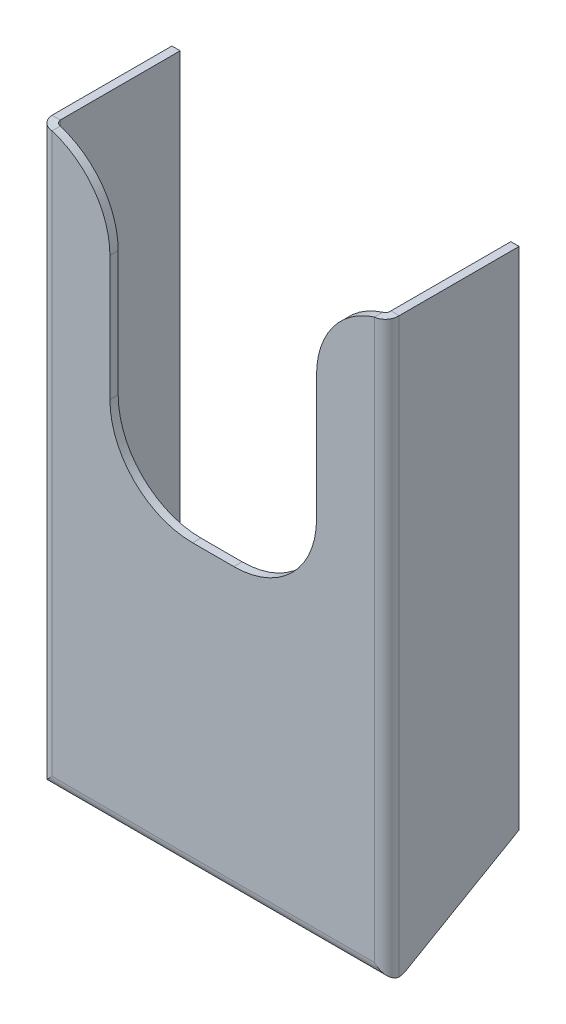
ISO-10303-21;
HEADER;
FILE_DESCRIPTION(('STEP AP214'),'2;1');
FILE_NAME('part.step','',(''),(''),'','','');
FILE_SCHEMA(('AUTOMOTIVE_DESIGN { 1 0 10303 214 1 1 1 1 }'));
ENDSEC;
DATA;
#1=APPLICATION_CONTEXT('core data for automotive mechanical design processes');
#2=APPLICATION_PROTOCOL_DEFINITION('international standard','automotive_design',2000,#1);
#3=PRODUCT_CONTEXT('',#1,'mechanical');
#4=PRODUCT('Part','Part','',(#3));
#5=PRODUCT_RELATED_PRODUCT_CATEGORY('part','',(#4));
#6=PRODUCT_DEFINITION_FORMATION('','',#4);
#7=PRODUCT_DEFINITION_CONTEXT('part definition',#1,'design');
#8=PRODUCT_DEFINITION('design','',#6,#7);
#9=PRODUCT_DEFINITION_SHAPE('','',#8);
#10=(LENGTH_UNIT() NAMED_UNIT(*) SI_UNIT(.MILLI.,.METRE.));
#11=(NAMED_UNIT(*) PLANE_ANGLE_UNIT() SI_UNIT($,.RADIAN.));
#12=(NAMED_UNIT(*) SI_UNIT($,.STERADIAN.) SOLID_ANGLE_UNIT());
#13=UNCERTAINTY_MEASURE_WITH_UNIT(LENGTH_MEASURE(1.E-05),#10,'distance_accuracy_value','');
#14=(GEOMETRIC_REPRESENTATION_CONTEXT(3) GLOBAL_UNCERTAINTY_ASSIGNED_CONTEXT((#13)) GLOBAL_UNIT_ASSIGNED_CONTEXT((#10,
#11,#12)) REPRESENTATION_CONTEXT('',''));
#15=CARTESIAN_POINT('',(0.,0.,0.));
#16=DIRECTION('',(0.,0.,1.));
#17=DIRECTION('',(1.,0.,0.));
#18=AXIS2_PLACEMENT_3D('',#15,#16,#17);
#19=CARTESIAN_POINT('',(-50.8,177.8,0.));
#20=DIRECTION('',(0.,0.,-1.));
#21=DIRECTION('',(-1.,0.,0.));
#22=AXIS2_PLACEMENT_3D('',#19,#20,#21);
#23=PLANE('',#22);
#24=DIRECTION('',(0.,-1.,0.));
#25=VECTOR('',#24,1.);
#26=CARTESIAN_POINT('',(49.53,176.917431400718,0.));
#27=LINE('',#26,#25);
#28=CARTESIAN_POINT('',(49.53,176.917431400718,0.));
#29=VERTEX_POINT('',#28);
#30=CARTESIAN_POINT('',(49.53,5.1326438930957,0.));
#31=VERTEX_POINT('',#30);
#32=EDGE_CURVE('E525',#29,#31,#27,.T.);
#33=ORIENTED_EDGE('',*,*,#32,.T.);
#34=DIRECTION('',(-1.,0.,0.));
#35=VECTOR('',#34,1.);
#36=CARTESIAN_POINT('',(-49.53,5.13264389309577,0.));
#37=LINE('',#36,#35);
#38=CARTESIAN_POINT('',(-49.53,5.13264389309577,0.));
#39=VERTEX_POINT('',#38);
#40=EDGE_CURVE('E76',#39,#31,#37,.F.);
#41=ORIENTED_EDGE('',*,*,#40,.F.);
#42=DIRECTION('',(0.,1.,0.));
#43=VECTOR('',#42,1.);
#44=CARTESIAN_POINT('',(-49.53,0.,0.));
#45=LINE('',#44,#43);
#46=CARTESIAN_POINT('',(-49.53,176.917431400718,0.));
#47=VERTEX_POINT('',#46);
#48=EDGE_CURVE('E482',#39,#47,#45,.T.);
#49=ORIENTED_EDGE('',*,*,#48,.T.);
#50=CARTESIAN_POINT('',(-57.15,152.687375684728,0.));
#51=DIRECTION('',(0.,0.,-1.));
#52=DIRECTION('',(-1.,0.,0.));
#53=AXIS2_PLACEMENT_3D('',#50,#51,#52);
#54=CIRCLE('',#53,25.4);
#55=CARTESIAN_POINT('',(-31.75,152.687375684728,0.));
#56=VERTEX_POINT('',#55);
#57=EDGE_CURVE('E445',#47,#56,#54,.T.);
#58=ORIENTED_EDGE('',*,*,#57,.T.);
#59=DIRECTION('',(0.,-1.,0.));
#60=VECTOR('',#59,1.);
#61=CARTESIAN_POINT('',(-31.75,177.8,0.));
#62=LINE('',#61,#60);
#63=CARTESIAN_POINT('',(-31.75,114.3,0.));
#64=VERTEX_POINT('',#63);
#65=EDGE_CURVE('E441',#56,#64,#62,.T.);
#66=ORIENTED_EDGE('',*,*,#65,.T.);
#67=CARTESIAN_POINT('',(-6.35,114.3,0.));
#68=DIRECTION('',(0.,0.,-1.));
#69=DIRECTION('',(-1.,0.,0.));
#70=AXIS2_PLACEMENT_3D('',#67,#68,#69);
#71=CIRCLE('',#70,25.4);
#72=CARTESIAN_POINT('',(-6.35,88.9,0.));
#73=VERTEX_POINT('',#72);
#74=EDGE_CURVE('E444',#64,#73,#71,.F.);
#75=ORIENTED_EDGE('',*,*,#74,.T.);
#76=DIRECTION('',(1.,0.,0.));
#77=VECTOR('',#76,1.);
#78=CARTESIAN_POINT('',(-50.8,88.9,0.));
#79=LINE('',#78,#77);
#80=CARTESIAN_POINT('',(6.34999999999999,88.9,0.));
#81=VERTEX_POINT('',#80);
#82=EDGE_CURVE('E448',#73,#81,#79,.T.);
#83=ORIENTED_EDGE('',*,*,#82,.T.);
#84=CARTESIAN_POINT('',(6.34999999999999,114.3,0.));
#85=DIRECTION('',(0.,0.,-1.));
#86=DIRECTION('',(-1.,0.,0.));
#87=AXIS2_PLACEMENT_3D('',#84,#85,#86);
#88=CIRCLE('',#87,25.4);
#89=CARTESIAN_POINT('',(31.75,114.3,0.));
#90=VERTEX_POINT('',#89);
#91=EDGE_CURVE('E451',#81,#90,#88,.F.);
#92=ORIENTED_EDGE('',*,*,#91,.T.);
#93=DIRECTION('',(0.,1.,0.));
#94=VECTOR('',#93,1.);
#95=CARTESIAN_POINT('',(31.75,177.8,0.));
#96=LINE('',#95,#94);
#97=CARTESIAN_POINT('',(31.75,152.687375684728,0.));
#98=VERTEX_POINT('',#97);
#99=EDGE_CURVE('E454',#90,#98,#96,.T.);
#100=ORIENTED_EDGE('',*,*,#99,.T.);
#101=CARTESIAN_POINT('',(57.15,152.687375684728,0.));
#102=DIRECTION('',(0.,0.,-1.));
#103=DIRECTION('',(-1.,0.,0.));
#104=AXIS2_PLACEMENT_3D('',#101,#102,#103);
#105=CIRCLE('',#104,25.4);
#106=EDGE_CURVE('E457',#98,#29,#105,.T.);
#107=ORIENTED_EDGE('',*,*,#106,.T.);
#108=EDGE_LOOP('',(#33,#41,#49,#58,#66,#75,#83,#92,#100,#107));
#109=FACE_BOUND('',#108,.T.);
#110=ADVANCED_FACE('F50',(#109),#23,.T.);
#111=CARTESIAN_POINT('',(-50.8,177.8,2.54));
#112=DIRECTION('',(0.,0.,-1.));
#113=DIRECTION('',(-1.,0.,0.));
#114=AXIS2_PLACEMENT_3D('',#111,#112,#113);
#115=PLANE('',#114);
#116=CARTESIAN_POINT('',(-57.15,152.687375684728,2.54));
#117=DIRECTION('',(0.,0.,-1.));
#118=DIRECTION('',(-1.,0.,0.));
#119=AXIS2_PLACEMENT_3D('',#116,#117,#118);
#120=CIRCLE('',#119,25.4);
#121=CARTESIAN_POINT('',(-31.75,152.687375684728,2.54));
#122=VERTEX_POINT('',#121);
#123=CARTESIAN_POINT('',(-49.53,176.917431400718,2.54));
#124=VERTEX_POINT('',#123);
#125=EDGE_CURVE('E427',#122,#124,#120,.F.);
#126=ORIENTED_EDGE('',*,*,#125,.T.);
#127=DIRECTION('',(0.,1.,0.));
#128=VECTOR('',#127,1.);
#129=CARTESIAN_POINT('',(-49.53,0.,2.53999999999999));
#130=LINE('',#129,#128);
#131=CARTESIAN_POINT('',(-49.53,5.1326438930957,2.53999999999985));
#132=VERTEX_POINT('',#131);
#133=EDGE_CURVE('E440',#132,#124,#130,.T.);
#134=ORIENTED_EDGE('',*,*,#133,.F.);
#135=DIRECTION('',(-1.,0.,0.));
#136=VECTOR('',#135,1.);
#137=CARTESIAN_POINT('',(-49.53,5.13264389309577,2.53999999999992));
#138=LINE('',#137,#136);
#139=CARTESIAN_POINT('',(49.53,5.1326438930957,2.53999999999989));
#140=VERTEX_POINT('',#139);
#141=EDGE_CURVE('E661',#132,#140,#138,.F.);
#142=ORIENTED_EDGE('',*,*,#141,.T.);
#143=DIRECTION('',(0.,-1.,0.));
#144=VECTOR('',#143,1.);
#145=CARTESIAN_POINT('',(49.53,176.917431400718,2.53999999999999));
#146=LINE('',#145,#144);
#147=CARTESIAN_POINT('',(49.53,176.917431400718,2.54));
#148=VERTEX_POINT('',#147);
#149=EDGE_CURVE('E590',#148,#140,#146,.T.);
#150=ORIENTED_EDGE('',*,*,#149,.F.);
#151=CARTESIAN_POINT('',(57.15,152.687375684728,2.54));
#152=DIRECTION('',(0.,0.,-1.));
#153=DIRECTION('',(-1.,0.,0.));
#154=AXIS2_PLACEMENT_3D('',#151,#152,#153);
#155=CIRCLE('',#154,25.4);
#156=CARTESIAN_POINT('',(31.75,152.687375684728,2.54));
#157=VERTEX_POINT('',#156);
#158=EDGE_CURVE('E433',#148,#157,#155,.F.);
#159=ORIENTED_EDGE('',*,*,#158,.T.);
#160=DIRECTION('',(0.,1.,0.));
#161=VECTOR('',#160,1.);
#162=CARTESIAN_POINT('',(31.75,177.8,2.54));
#163=LINE('',#162,#161);
#164=CARTESIAN_POINT('',(31.75,114.3,2.54));
#165=VERTEX_POINT('',#164);
#166=EDGE_CURVE('E429',#165,#157,#163,.T.);
#167=ORIENTED_EDGE('',*,*,#166,.F.);
#168=CARTESIAN_POINT('',(6.34999999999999,114.3,2.54));
#169=DIRECTION('',(0.,0.,-1.));
#170=DIRECTION('',(-1.,0.,0.));
#171=AXIS2_PLACEMENT_3D('',#168,#169,#170);
#172=CIRCLE('',#171,25.4);
#173=CARTESIAN_POINT('',(6.34999999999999,88.9,2.54));
#174=VERTEX_POINT('',#173);
#175=EDGE_CURVE('E432',#165,#174,#172,.T.);
#176=ORIENTED_EDGE('',*,*,#175,.T.);
#177=DIRECTION('',(1.,0.,0.));
#178=VECTOR('',#177,1.);
#179=CARTESIAN_POINT('',(-50.8,88.9,2.54));
#180=LINE('',#179,#178);
#181=CARTESIAN_POINT('',(-6.35,88.9,2.54));
#182=VERTEX_POINT('',#181);
#183=EDGE_CURVE('E435',#182,#174,#180,.T.);
#184=ORIENTED_EDGE('',*,*,#183,.F.);
#185=CARTESIAN_POINT('',(-6.35,114.3,2.54));
#186=DIRECTION('',(0.,0.,-1.));
#187=DIRECTION('',(-1.,0.,0.));
#188=AXIS2_PLACEMENT_3D('',#185,#186,#187);
#189=CIRCLE('',#188,25.4);
#190=CARTESIAN_POINT('',(-31.75,114.3,2.54));
#191=VERTEX_POINT('',#190);
#192=EDGE_CURVE('E438',#182,#191,#189,.T.);
#193=ORIENTED_EDGE('',*,*,#192,.T.);
#194=DIRECTION('',(0.,-1.,0.));
#195=VECTOR('',#194,1.);
#196=CARTESIAN_POINT('',(-31.75,177.8,2.54));
#197=LINE('',#196,#195);
#198=EDGE_CURVE('E419',#122,#191,#197,.T.);
#199=ORIENTED_EDGE('',*,*,#198,.F.);
#200=EDGE_LOOP('',(#126,#134,#142,#150,#159,#167,#176,#184,#193,#199));
#201=FACE_BOUND('',#200,.T.);
#202=ADVANCED_FACE('F380',(#201),#115,.F.);
#203=CARTESIAN_POINT('',(-311.332230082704,177.8,-38.1000000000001));
#204=DIRECTION('',(0.,0.,1.));
#205=DIRECTION('',(1.,0.,0.));
#206=AXIS2_PLACEMENT_3D('',#203,#204,#205);
#207=PLANE('',#206);
#208=DIRECTION('',(0.,-1.,0.));
#209=VECTOR('',#208,1.);
#210=CARTESIAN_POINT('',(53.34,177.8,-38.1));
#211=LINE('',#210,#209);
#212=CARTESIAN_POINT('',(53.34,177.280819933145,-38.1));
#213=VERTEX_POINT('',#212);
#214=CARTESIAN_POINT('',(53.34,21.9970452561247,-38.1));
#215=VERTEX_POINT('',#214);
#216=EDGE_CURVE('E583',#213,#215,#211,.T.);
#217=ORIENTED_EDGE('',*,*,#216,.T.);
#218=DIRECTION('',(-1.,0.,0.));
#219=VECTOR('',#218,1.);
#220=CARTESIAN_POINT('',(-311.332230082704,21.9970452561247,-38.1000000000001));
#221=LINE('',#220,#219);
#222=CARTESIAN_POINT('',(50.8,21.9970452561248,-38.1));
#223=VERTEX_POINT('',#222);
#224=EDGE_CURVE('E238',#215,#223,#221,.T.);
#225=ORIENTED_EDGE('',*,*,#224,.T.);
#226=DIRECTION('',(0.,-1.,0.));
#227=VECTOR('',#226,1.);
#228=CARTESIAN_POINT('',(50.8,177.8,-38.1));
#229=LINE('',#228,#227);
#230=CARTESIAN_POINT('',(50.8,177.280819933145,-38.1));
#231=VERTEX_POINT('',#230);
#232=EDGE_CURVE('E13',#231,#223,#229,.T.);
#233=ORIENTED_EDGE('',*,*,#232,.F.);
#234=DIRECTION('',(1.,0.,0.));
#235=VECTOR('',#234,1.);
#236=CARTESIAN_POINT('',(-311.332230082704,177.280819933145,-38.1000000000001));
#237=LINE('',#236,#235);
#238=EDGE_CURVE('E565',#231,#213,#237,.T.);
#239=ORIENTED_EDGE('',*,*,#238,.T.);
#240=EDGE_LOOP('',(#217,#225,#233,#239));
#241=FACE_BOUND('',#240,.T.);
#242=ADVANCED_FACE('F544',(#241),#207,.F.);
#243=CARTESIAN_POINT('',(-311.332230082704,177.280819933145,-1.31838984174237E-13));
#244=DIRECTION('',(0.,-1.,0.));
#245=DIRECTION('',(-1.,0.,0.));
#246=AXIS2_PLACEMENT_3D('',#243,#244,#245);
#247=PLANE('',#246);
#248=CARTESIAN_POINT('',(53.34,177.280819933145,-1.26999999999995));
#249=CARTESIAN_POINT('',(50.8,177.280819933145,-1.26999999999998));
#250=B_SPLINE_CURVE_WITH_KNOTS('',1,(#248,#249),.UNSPECIFIED.,.F.,.F.,(2,2),(0.,1.),.UNSPECIFIED.);
#251=CARTESIAN_POINT('',(50.8,177.280819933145,-1.26999999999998));
#252=VERTEX_POINT('',#251);
#253=CARTESIAN_POINT('',(53.34,177.280819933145,-1.26999999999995));
#254=VERTEX_POINT('',#253);
#255=EDGE_CURVE('E575',#252,#254,#250,.F.);
#256=ORIENTED_EDGE('',*,*,#255,.T.);
#257=DIRECTION('',(0.,0.,-1.));
#258=VECTOR('',#257,1.);
#259=CARTESIAN_POINT('',(53.34,177.280819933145,0.));
#260=LINE('',#259,#258);
#261=EDGE_CURVE('E573',#254,#213,#260,.T.);
#262=ORIENTED_EDGE('',*,*,#261,.T.);
#263=ORIENTED_EDGE('',*,*,#238,.F.);
#264=DIRECTION('',(0.,0.,-1.));
#265=VECTOR('',#264,1.);
#266=CARTESIAN_POINT('',(50.8,177.280819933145,0.));
#267=LINE('',#266,#265);
#268=EDGE_CURVE('E60',#252,#231,#267,.T.);
#269=ORIENTED_EDGE('',*,*,#268,.F.);
#270=EDGE_LOOP('',(#256,#262,#263,#269));
#271=FACE_BOUND('',#270,.T.);
#272=ADVANCED_FACE('F547',(#271),#247,.F.);
#273=CARTESIAN_POINT('',(53.34,177.8,0.));
#274=DIRECTION('',(-1.,0.,0.));
#275=DIRECTION('',(0.,0.,1.));
#276=AXIS2_PLACEMENT_3D('',#273,#274,#275);
#277=PLANE('',#276);
#278=DIRECTION('',(0.,-1.,0.));
#279=VECTOR('',#278,1.);
#280=CARTESIAN_POINT('',(53.34,177.280819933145,-1.27));
#281=LINE('',#280,#279);
#282=CARTESIAN_POINT('',(53.34,1.3226438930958,-1.27));
#283=VERTEX_POINT('',#282);
#284=EDGE_CURVE('E246',#254,#283,#281,.T.);
#285=ORIENTED_EDGE('',*,*,#284,.T.);
#286=CARTESIAN_POINT('',(53.34,5.13264389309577,-1.27000000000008));
#287=DIRECTION('',(-1.,0.,0.));
#288=DIRECTION('',(0.,0.,-1.));
#289=AXIS2_PLACEMENT_3D('',#286,#287,#288);
#290=CIRCLE('',#289,3.80999999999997);
#291=CARTESIAN_POINT('',(53.34,1.83308710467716,-3.17500000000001));
#292=VERTEX_POINT('',#291);
#293=EDGE_CURVE('E226',#292,#283,#290,.T.);
#294=ORIENTED_EDGE('',*,*,#293,.F.);
#295=DIRECTION('',(0.,-0.499999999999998,0.86602540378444));
#296=VECTOR('',#295,1.);
#297=CARTESIAN_POINT('',(53.34,28.0540344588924,-48.5910130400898));
#298=LINE('',#297,#296);
#299=EDGE_CURVE('E235',#215,#292,#298,.T.);
#300=ORIENTED_EDGE('',*,*,#299,.F.);
#301=ORIENTED_EDGE('',*,*,#216,.F.);
#302=ORIENTED_EDGE('',*,*,#261,.F.);
#303=EDGE_LOOP('',(#285,#294,#300,#301,#302));
#304=FACE_BOUND('',#303,.T.);
#305=ADVANCED_FACE('F244',(#304),#277,.F.);
#306=CARTESIAN_POINT('',(50.8,177.8,0.));
#307=DIRECTION('',(-1.,0.,0.));
#308=DIRECTION('',(0.,0.,1.));
#309=AXIS2_PLACEMENT_3D('',#306,#307,#308);
#310=PLANE('',#309);
#311=CARTESIAN_POINT('',(50.8,5.13264389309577,-1.27000000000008));
#312=DIRECTION('',(-1.,0.,0.));
#313=DIRECTION('',(0.,0.,1.));
#314=AXIS2_PLACEMENT_3D('',#311,#312,#313);
#315=CIRCLE('',#314,3.80999999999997);
#316=CARTESIAN_POINT('',(50.8,1.32264389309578,-1.27));
#317=VERTEX_POINT('',#316);
#318=CARTESIAN_POINT('',(50.8,1.83308710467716,-3.17500000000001));
#319=VERTEX_POINT('',#318);
#320=EDGE_CURVE('E229',#317,#319,#315,.F.);
#321=ORIENTED_EDGE('',*,*,#320,.F.);
#322=DIRECTION('',(0.,-1.,0.));
#323=VECTOR('',#322,1.);
#324=CARTESIAN_POINT('',(50.8,177.280819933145,-1.27));
#325=LINE('',#324,#323);
#326=EDGE_CURVE('E515',#252,#317,#325,.T.);
#327=ORIENTED_EDGE('',*,*,#326,.F.);
#328=ORIENTED_EDGE('',*,*,#268,.T.);
#329=ORIENTED_EDGE('',*,*,#232,.T.);
#330=DIRECTION('',(0.,0.499999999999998,-0.86602540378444));
#331=VECTOR('',#330,1.);
#332=CARTESIAN_POINT('',(50.8,44.4499999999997,-76.9896583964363));
#333=LINE('',#332,#331);
#334=EDGE_CURVE('E256',#319,#223,#333,.T.);
#335=ORIENTED_EDGE('',*,*,#334,.F.);
#336=EDGE_LOOP('',(#321,#327,#328,#329,#335));
#337=FACE_BOUND('',#336,.T.);
#338=ADVANCED_FACE('F52',(#337),#310,.T.);
#339=CARTESIAN_POINT('',(311.332230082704,177.8,-38.1000000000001));
#340=DIRECTION('',(0.,0.,-1.));
#341=DIRECTION('',(-1.,0.,0.));
#342=AXIS2_PLACEMENT_3D('',#339,#340,#341);
#343=PLANE('',#342);
#344=DIRECTION('',(1.,0.,0.));
#345=VECTOR('',#344,1.);
#346=CARTESIAN_POINT('',(311.332230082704,21.9970452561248,-38.1000000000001));
#347=LINE('',#346,#345);
#348=CARTESIAN_POINT('',(-53.34,21.9970452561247,-38.1));
#349=VERTEX_POINT('',#348);
#350=CARTESIAN_POINT('',(-50.8,21.9970452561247,-38.1));
#351=VERTEX_POINT('',#350);
#352=EDGE_CURVE('E251',#349,#351,#347,.T.);
#353=ORIENTED_EDGE('',*,*,#352,.F.);
#354=DIRECTION('',(0.,-1.,0.));
#355=VECTOR('',#354,1.);
#356=CARTESIAN_POINT('',(-53.34,177.8,-38.1));
#357=LINE('',#356,#355);
#358=CARTESIAN_POINT('',(-53.34,177.280819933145,-38.1));
#359=VERTEX_POINT('',#358);
#360=EDGE_CURVE('E499',#359,#349,#357,.T.);
#361=ORIENTED_EDGE('',*,*,#360,.F.);
#362=DIRECTION('',(-1.,0.,0.));
#363=VECTOR('',#362,1.);
#364=CARTESIAN_POINT('',(311.332230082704,177.280819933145,-38.1000000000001));
#365=LINE('',#364,#363);
#366=CARTESIAN_POINT('',(-50.8,177.280819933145,-38.1));
#367=VERTEX_POINT('',#366);
#368=EDGE_CURVE('E494',#367,#359,#365,.T.);
#369=ORIENTED_EDGE('',*,*,#368,.F.);
#370=DIRECTION('',(0.,-1.,0.));
#371=VECTOR('',#370,1.);
#372=CARTESIAN_POINT('',(-50.8,177.8,-38.1));
#373=LINE('',#372,#371);
#374=EDGE_CURVE('E502',#367,#351,#373,.T.);
#375=ORIENTED_EDGE('',*,*,#374,.T.);
#376=EDGE_LOOP('',(#353,#361,#369,#375));
#377=FACE_BOUND('',#376,.T.);
#378=ADVANCED_FACE('F629',(#377),#343,.T.);
#379=CARTESIAN_POINT('',(-53.34,177.8,-38.1));
#380=DIRECTION('',(1.,0.,0.));
#381=DIRECTION('',(0.,0.,-1.));
#382=AXIS2_PLACEMENT_3D('',#379,#380,#381);
#383=PLANE('',#382);
#384=DIRECTION('',(0.,-0.499999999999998,0.86602540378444));
#385=VECTOR('',#384,1.);
#386=CARTESIAN_POINT('',(-53.34,60.9477839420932,-105.564658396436));
#387=LINE('',#386,#385);
#388=CARTESIAN_POINT('',(-53.34,1.83308710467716,-3.17500000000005));
#389=VERTEX_POINT('',#388);
#390=EDGE_CURVE('E253',#349,#389,#387,.T.);
#391=ORIENTED_EDGE('',*,*,#390,.T.);
#392=CARTESIAN_POINT('',(-53.34,5.13264389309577,-1.27000000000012));
#393=DIRECTION('',(1.,0.,0.));
#394=DIRECTION('',(0.,0.,-1.));
#395=AXIS2_PLACEMENT_3D('',#392,#393,#394);
#396=CIRCLE('',#395,3.80999999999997);
#397=CARTESIAN_POINT('',(-53.34,1.32264389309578,-1.27));
#398=VERTEX_POINT('',#397);
#399=EDGE_CURVE('E665',#389,#398,#396,.F.);
#400=ORIENTED_EDGE('',*,*,#399,.T.);
#401=DIRECTION('',(0.,1.,0.));
#402=VECTOR('',#401,1.);
#403=CARTESIAN_POINT('',(-53.34,0.,-1.27));
#404=LINE('',#403,#402);
#405=CARTESIAN_POINT('',(-53.34,177.280819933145,-1.27));
#406=VERTEX_POINT('',#405);
#407=EDGE_CURVE('E54',#398,#406,#404,.T.);
#408=ORIENTED_EDGE('',*,*,#407,.T.);
#409=DIRECTION('',(0.,0.,1.));
#410=VECTOR('',#409,1.);
#411=CARTESIAN_POINT('',(-53.34,177.280819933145,-38.1));
#412=LINE('',#411,#410);
#413=EDGE_CURVE('E498',#359,#406,#412,.T.);
#414=ORIENTED_EDGE('',*,*,#413,.F.);
#415=ORIENTED_EDGE('',*,*,#360,.T.);
#416=EDGE_LOOP('',(#391,#400,#408,#414,#415));
#417=FACE_BOUND('',#416,.T.);
#418=ADVANCED_FACE('F538',(#417),#383,.F.);
#419=CARTESIAN_POINT('',(311.332230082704,177.280819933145,-38.1000000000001));
#420=DIRECTION('',(0.,-1.,0.));
#421=DIRECTION('',(1.,0.,0.));
#422=AXIS2_PLACEMENT_3D('',#419,#420,#421);
#423=PLANE('',#422);
#424=ORIENTED_EDGE('',*,*,#368,.T.);
#425=ORIENTED_EDGE('',*,*,#413,.T.);
#426=CARTESIAN_POINT('',(-50.8,177.280819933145,-1.27));
#427=CARTESIAN_POINT('',(-53.34,177.280819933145,-1.27));
#428=B_SPLINE_CURVE_WITH_KNOTS('',1,(#426,#427),.UNSPECIFIED.,.F.,.F.,(2,2),(0.,1.),.UNSPECIFIED.);
#429=CARTESIAN_POINT('',(-50.8,177.280819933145,-1.26999999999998));
#430=VERTEX_POINT('',#429);
#431=EDGE_CURVE('E505',#430,#406,#428,.T.);
#432=ORIENTED_EDGE('',*,*,#431,.F.);
#433=DIRECTION('',(0.,0.,1.));
#434=VECTOR('',#433,1.);
#435=CARTESIAN_POINT('',(-50.8,177.280819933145,-38.1));
#436=LINE('',#435,#434);
#437=EDGE_CURVE('E508',#367,#430,#436,.T.);
#438=ORIENTED_EDGE('',*,*,#437,.F.);
#439=EDGE_LOOP('',(#424,#425,#432,#438));
#440=FACE_BOUND('',#439,.T.);
#441=ADVANCED_FACE('F527',(#440),#423,.F.);
#442=CARTESIAN_POINT('',(-50.8,177.8,-38.1));
#443=DIRECTION('',(1.,0.,0.));
#444=DIRECTION('',(0.,0.,-1.));
#445=AXIS2_PLACEMENT_3D('',#442,#443,#444);
#446=PLANE('',#445);
#447=CARTESIAN_POINT('',(-50.8,5.13264389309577,-1.27000000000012));
#448=DIRECTION('',(1.,0.,0.));
#449=DIRECTION('',(0.,0.,-1.));
#450=AXIS2_PLACEMENT_3D('',#447,#448,#449);
#451=CIRCLE('',#450,3.80999999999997);
#452=CARTESIAN_POINT('',(-50.8,1.83308710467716,-3.17500000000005));
#453=VERTEX_POINT('',#452);
#454=CARTESIAN_POINT('',(-50.8,1.3226438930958,-1.27));
#455=VERTEX_POINT('',#454);
#456=EDGE_CURVE('E68',#453,#455,#451,.F.);
#457=ORIENTED_EDGE('',*,*,#456,.F.);
#458=DIRECTION('',(0.,-0.499999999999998,0.86602540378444));
#459=VECTOR('',#458,1.);
#460=CARTESIAN_POINT('',(-50.8,60.9477839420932,-105.564658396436));
#461=LINE('',#460,#459);
#462=EDGE_CURVE('E249',#351,#453,#461,.T.);
#463=ORIENTED_EDGE('',*,*,#462,.F.);
#464=ORIENTED_EDGE('',*,*,#374,.F.);
#465=ORIENTED_EDGE('',*,*,#437,.T.);
#466=DIRECTION('',(0.,1.,0.));
#467=VECTOR('',#466,1.);
#468=CARTESIAN_POINT('',(-50.8,0.,-1.27));
#469=LINE('',#468,#467);
#470=EDGE_CURVE('E487',#455,#430,#469,.T.);
#471=ORIENTED_EDGE('',*,*,#470,.F.);
#472=EDGE_LOOP('',(#457,#463,#464,#465,#471));
#473=FACE_BOUND('',#472,.T.);
#474=ADVANCED_FACE('F537',(#473),#446,.T.);
#475=CARTESIAN_POINT('',(-57.15,152.687375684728,-405.525146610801));
#476=DIRECTION('',(0.,0.,1.));
#477=DIRECTION('',(1.,0.,0.));
#478=AXIS2_PLACEMENT_3D('',#475,#476,#477);
#479=CYLINDRICAL_SURFACE('',#478,25.4);
#480=CARTESIAN_POINT('',(-49.53,176.917431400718,2.54));
#481=CARTESIAN_POINT('',(-49.53,176.917431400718,0.));
#482=B_SPLINE_CURVE_WITH_KNOTS('',1,(#480,#481),.UNSPECIFIED.,.F.,.F.,(2,2),(0.,1.),.UNSPECIFIED.);
#483=EDGE_CURVE('E414',#47,#124,#482,.F.);
#484=ORIENTED_EDGE('',*,*,#483,.T.);
#485=ORIENTED_EDGE('',*,*,#125,.F.);
#486=DIRECTION('',(0.,0.,1.));
#487=VECTOR('',#486,1.);
#488=CARTESIAN_POINT('',(-31.75,152.687375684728,-405.525146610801));
#489=LINE('',#488,#487);
#490=EDGE_CURVE('E473',#56,#122,#489,.T.);
#491=ORIENTED_EDGE('',*,*,#490,.F.);
#492=ORIENTED_EDGE('',*,*,#57,.F.);
#493=EDGE_LOOP('',(#484,#485,#491,#492));
#494=FACE_BOUND('',#493,.T.);
#495=ADVANCED_FACE('F542',(#494),#479,.T.);
#496=CARTESIAN_POINT('',(-31.75,177.8,-405.525146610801));
#497=DIRECTION('',(-1.,0.,0.));
#498=DIRECTION('',(0.,0.,1.));
#499=AXIS2_PLACEMENT_3D('',#496,#497,#498);
#500=PLANE('',#499);
#501=ORIENTED_EDGE('',*,*,#490,.T.);
#502=ORIENTED_EDGE('',*,*,#198,.T.);
#503=DIRECTION('',(0.,0.,1.));
#504=VECTOR('',#503,1.);
#505=CARTESIAN_POINT('',(-31.75,114.3,-405.525146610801));
#506=LINE('',#505,#504);
#507=EDGE_CURVE('E470',#64,#191,#506,.T.);
#508=ORIENTED_EDGE('',*,*,#507,.F.);
#509=ORIENTED_EDGE('',*,*,#65,.F.);
#510=EDGE_LOOP('',(#501,#502,#508,#509));
#511=FACE_BOUND('',#510,.T.);
#512=ADVANCED_FACE('F621',(#511),#500,.F.);
#513=CARTESIAN_POINT('',(-6.35,114.3,-405.525146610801));
#514=DIRECTION('',(0.,0.,1.));
#515=DIRECTION('',(1.,0.,0.));
#516=AXIS2_PLACEMENT_3D('',#513,#514,#515);
#517=CYLINDRICAL_SURFACE('',#516,25.4);
#518=ORIENTED_EDGE('',*,*,#507,.T.);
#519=ORIENTED_EDGE('',*,*,#192,.F.);
#520=DIRECTION('',(0.,0.,1.));
#521=VECTOR('',#520,1.);
#522=CARTESIAN_POINT('',(-6.35,88.9,-405.525146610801));
#523=LINE('',#522,#521);
#524=EDGE_CURVE('E467',#73,#182,#523,.T.);
#525=ORIENTED_EDGE('',*,*,#524,.F.);
#526=ORIENTED_EDGE('',*,*,#74,.F.);
#527=EDGE_LOOP('',(#518,#519,#525,#526));
#528=FACE_BOUND('',#527,.T.);
#529=ADVANCED_FACE('F617',(#528),#517,.F.);
#530=CARTESIAN_POINT('',(-50.8,88.9,-405.525146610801));
#531=DIRECTION('',(0.,-1.,0.));
#532=DIRECTION('',(0.,0.,-1.));
#533=AXIS2_PLACEMENT_3D('',#530,#531,#532);
#534=PLANE('',#533);
#535=ORIENTED_EDGE('',*,*,#524,.T.);
#536=ORIENTED_EDGE('',*,*,#183,.T.);
#537=DIRECTION('',(0.,0.,1.));
#538=VECTOR('',#537,1.);
#539=CARTESIAN_POINT('',(6.34999999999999,88.9,-405.525146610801));
#540=LINE('',#539,#538);
#541=EDGE_CURVE('E464',#81,#174,#540,.T.);
#542=ORIENTED_EDGE('',*,*,#541,.F.);
#543=ORIENTED_EDGE('',*,*,#82,.F.);
#544=EDGE_LOOP('',(#535,#536,#542,#543));
#545=FACE_BOUND('',#544,.T.);
#546=ADVANCED_FACE('F613',(#545),#534,.F.);
#547=CARTESIAN_POINT('',(6.34999999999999,114.3,-405.525146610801));
#548=DIRECTION('',(0.,0.,1.));
#549=DIRECTION('',(1.,0.,0.));
#550=AXIS2_PLACEMENT_3D('',#547,#548,#549);
#551=CYLINDRICAL_SURFACE('',#550,25.4);
#552=ORIENTED_EDGE('',*,*,#541,.T.);
#553=ORIENTED_EDGE('',*,*,#175,.F.);
#554=DIRECTION('',(0.,0.,1.));
#555=VECTOR('',#554,1.);
#556=CARTESIAN_POINT('',(31.75,114.3,-405.525146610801));
#557=LINE('',#556,#555);
#558=EDGE_CURVE('E461',#90,#165,#557,.T.);
#559=ORIENTED_EDGE('',*,*,#558,.F.);
#560=ORIENTED_EDGE('',*,*,#91,.F.);
#561=EDGE_LOOP('',(#552,#553,#559,#560));
#562=FACE_BOUND('',#561,.T.);
#563=ADVANCED_FACE('F609',(#562),#551,.F.);
#564=CARTESIAN_POINT('',(31.75,177.8,-405.525146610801));
#565=DIRECTION('',(1.,0.,0.));
#566=DIRECTION('',(0.,0.,-1.));
#567=AXIS2_PLACEMENT_3D('',#564,#565,#566);
#568=PLANE('',#567);
#569=ORIENTED_EDGE('',*,*,#558,.T.);
#570=ORIENTED_EDGE('',*,*,#166,.T.);
#571=DIRECTION('',(0.,0.,1.));
#572=VECTOR('',#571,1.);
#573=CARTESIAN_POINT('',(31.75,152.687375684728,-405.525146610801));
#574=LINE('',#573,#572);
#575=EDGE_CURVE('E458',#98,#157,#574,.T.);
#576=ORIENTED_EDGE('',*,*,#575,.F.);
#577=ORIENTED_EDGE('',*,*,#99,.F.);
#578=EDGE_LOOP('',(#569,#570,#576,#577));
#579=FACE_BOUND('',#578,.T.);
#580=ADVANCED_FACE('F605',(#579),#568,.F.);
#581=CARTESIAN_POINT('',(57.15,152.687375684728,-405.525146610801));
#582=DIRECTION('',(0.,0.,1.));
#583=DIRECTION('',(1.,0.,0.));
#584=AXIS2_PLACEMENT_3D('',#581,#582,#583);
#585=CYLINDRICAL_SURFACE('',#584,25.4);
#586=ORIENTED_EDGE('',*,*,#575,.T.);
#587=ORIENTED_EDGE('',*,*,#158,.F.);
#588=CARTESIAN_POINT('',(49.53,176.917431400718,0.));
#589=CARTESIAN_POINT('',(49.53,176.917431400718,2.54));
#590=B_SPLINE_CURVE_WITH_KNOTS('',1,(#588,#589),.UNSPECIFIED.,.F.,.F.,(2,2),(0.,1.),.UNSPECIFIED.);
#591=EDGE_CURVE('E348',#29,#148,#590,.T.);
#592=ORIENTED_EDGE('',*,*,#591,.F.);
#593=ORIENTED_EDGE('',*,*,#106,.F.);
#594=EDGE_LOOP('',(#586,#587,#592,#593));
#595=FACE_BOUND('',#594,.T.);
#596=ADVANCED_FACE('F378',(#595),#585,.T.);
#597=CARTESIAN_POINT('',(-49.53,176.917431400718,2.54));
#598=CARTESIAN_POINT('',(-50.0288174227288,176.947719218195,2.54));
#599=CARTESIAN_POINT('',(-50.5272594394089,176.977996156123,2.44083589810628));
#600=CARTESIAN_POINT('',(-51.4487883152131,177.038560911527,2.05912613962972));
#601=CARTESIAN_POINT('',(-51.8714230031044,177.068843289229,1.77673066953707));
#602=CARTESIAN_POINT('',(-52.5767306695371,177.129408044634,1.07142300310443));
#603=CARTESIAN_POINT('',(-52.8591261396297,177.159690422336,0.648788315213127));
#604=CARTESIAN_POINT('',(-53.2408358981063,177.22025517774,-0.272740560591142));
#605=CARTESIAN_POINT('',(-53.34,177.250532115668,-0.771182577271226));
#606=CARTESIAN_POINT('',(-53.34,177.280819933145,-1.27));
#607=CARTESIAN_POINT('',(-49.53,176.917431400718,0.));
#608=CARTESIAN_POINT('',(-49.6962716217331,176.947719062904,0.));
#609=CARTESIAN_POINT('',(-49.8624198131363,176.977996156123,-0.0330547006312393));
#610=CARTESIAN_POINT('',(-50.169596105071,177.038560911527,-0.160291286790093));
#611=CARTESIAN_POINT('',(-50.3104743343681,177.068843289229,-0.254423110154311));
#612=CARTESIAN_POINT('',(-50.5455768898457,177.129408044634,-0.489525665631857));
#613=CARTESIAN_POINT('',(-50.6397087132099,177.159690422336,-0.630403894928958));
#614=CARTESIAN_POINT('',(-50.7669452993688,177.22025517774,-0.937580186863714));
#615=CARTESIAN_POINT('',(-50.8,177.250532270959,-1.10372837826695));
#616=CARTESIAN_POINT('',(-50.8,177.280819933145,-1.27));
#617=B_SPLINE_SURFACE_WITH_KNOTS('',1,3,((#597,#598,#599,#600,#601,#602,#603,#604,#605,#606),
(#607,#608,#609,#610,#611,#612,#613,#614,#615,#616)),.UNSPECIFIED.,.F.,.F.,.F.,(2,2),(4,2,2,2,
4),(0.,1.),(0.,0.25,0.5,0.75,1.),.UNSPECIFIED.);
#618=CARTESIAN_POINT('',(-49.53,176.917431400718,0.));
#619=CARTESIAN_POINT('',(-49.6962716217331,176.947719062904,0.));
#620=CARTESIAN_POINT('',(-49.8624198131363,176.977996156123,-0.0330547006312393));
#621=CARTESIAN_POINT('',(-50.169596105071,177.038560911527,-0.160291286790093));
#622=CARTESIAN_POINT('',(-50.3104743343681,177.068843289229,-0.254423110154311));
#623=CARTESIAN_POINT('',(-50.5455768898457,177.129408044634,-0.489525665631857));
#624=CARTESIAN_POINT('',(-50.6397087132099,177.159690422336,-0.630403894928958));
#625=CARTESIAN_POINT('',(-50.7669452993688,177.22025517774,-0.937580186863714));
#626=CARTESIAN_POINT('',(-50.8,177.250532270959,-1.10372837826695));
#627=CARTESIAN_POINT('',(-50.8,177.280819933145,-1.27));
#628=B_SPLINE_CURVE_WITH_KNOTS('',3,(#618,#619,#620,#621,#622,#623,#624,#625,#626,#627),
.UNSPECIFIED.,.F.,.F.,(4,2,2,2,4),(0.,0.25,0.5,0.75,1.),.UNSPECIFIED.);
#629=EDGE_CURVE('E728',#47,#430,#628,.T.);
#630=CARTESIAN_POINT('',(-53.34,177.280819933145,-1.27));
#631=CARTESIAN_POINT('',(-53.34,177.250532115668,-0.771182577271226));
#632=CARTESIAN_POINT('',(-53.2408358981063,177.22025517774,-0.272740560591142));
#633=CARTESIAN_POINT('',(-52.8591261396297,177.159690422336,0.648788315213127));
#634=CARTESIAN_POINT('',(-52.5767306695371,177.129408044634,1.07142300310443));
#635=CARTESIAN_POINT('',(-51.8714230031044,177.068843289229,1.77673066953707));
#636=CARTESIAN_POINT('',(-51.4487883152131,177.038560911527,2.05912613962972));
#637=CARTESIAN_POINT('',(-50.5272594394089,176.977996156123,2.44083589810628));
#638=CARTESIAN_POINT('',(-50.0288174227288,176.947719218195,2.54));
#639=CARTESIAN_POINT('',(-49.53,176.917431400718,2.54));
#640=B_SPLINE_CURVE_WITH_KNOTS('',3,(#630,#631,#632,#633,#634,#635,#636,#637,#638,#639),
.UNSPECIFIED.,.F.,.F.,(4,2,2,2,4),(0.,0.25,0.5,0.75,1.),.UNSPECIFIED.);
#641=EDGE_CURVE('E428',#124,#406,#640,.F.);
#642=ORIENTED_EDGE('',*,*,#483,.F.);
#643=ORIENTED_EDGE('',*,*,#629,.T.);
#644=ORIENTED_EDGE('',*,*,#431,.T.);
#645=ORIENTED_EDGE('',*,*,#641,.F.);
#646=EDGE_LOOP('',(#642,#643,#644,#645));
#647=FACE_BOUND('',#646,.T.);
#648=ADVANCED_FACE('F371',(#647),#617,.T.);
#649=CARTESIAN_POINT('',(-49.53,-252.585738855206,-1.27));
#650=DIRECTION('',(0.,1.,0.));
#651=DIRECTION('',(0.,0.,1.));
#652=AXIS2_PLACEMENT_3D('',#649,#650,#651);
#653=CYLINDRICAL_SURFACE('',#652,3.81);
#654=CARTESIAN_POINT('',(-49.53,5.13264389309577,-1.27000000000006));
#655=DIRECTION('',(-0.707106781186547,0.707106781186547,0.));
#656=DIRECTION('',(0.707106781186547,0.707106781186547,0.));
#657=AXIS2_PLACEMENT_3D('',#654,#655,#656);
#658=ELLIPSE('',#657,5.38815367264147,3.80999999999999);
#659=EDGE_CURVE('E664',#132,#398,#658,.F.);
#660=ORIENTED_EDGE('',*,*,#659,.F.);
#661=ORIENTED_EDGE('',*,*,#133,.T.);
#662=ORIENTED_EDGE('',*,*,#641,.T.);
#663=ORIENTED_EDGE('',*,*,#407,.F.);
#664=EDGE_LOOP('',(#660,#661,#662,#663));
#665=FACE_BOUND('',#664,.T.);
#666=ADVANCED_FACE('F362',(#665),#653,.T.);
#667=CARTESIAN_POINT('',(-49.53,-252.585738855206,-1.27));
#668=DIRECTION('',(0.,1.,0.));
#669=DIRECTION('',(0.,0.,1.));
#670=AXIS2_PLACEMENT_3D('',#667,#668,#669);
#671=CYLINDRICAL_SURFACE('',#670,1.27);
#672=CARTESIAN_POINT('',(-49.53,1.54054144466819,0.));
#673=VERTEX_POINT('',#672);
#674=EDGE_CURVE('E485',#673,#39,#45,.T.);
#675=ORIENTED_EDGE('',*,*,#674,.F.);
#676=CARTESIAN_POINT('',(-49.53,1.54054144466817,0.));
#677=CARTESIAN_POINT('',(-49.5646601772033,1.54054487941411,9.4940673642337E-07));
#678=CARTESIAN_POINT('',(-49.5993026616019,1.54003915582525,-0.00141980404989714));
#679=CARTESIAN_POINT('',(-49.6683188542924,1.53804425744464,-0.00707998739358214));
#680=CARTESIAN_POINT('',(-49.702692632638,1.53655534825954,-0.0113186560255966));
#681=CARTESIAN_POINT('',(-49.8048228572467,1.53068100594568,-0.0281816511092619));
#682=CARTESIAN_POINT('',(-49.8718620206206,1.52488741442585,-0.0449534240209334));
#683=CARTESIAN_POINT('',(-50.0019628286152,1.51024747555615,-0.088952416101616));
#684=CARTESIAN_POINT('',(-50.0650265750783,1.50140275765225,-0.116174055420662));
#685=CARTESIAN_POINT('',(-50.1857495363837,1.48166368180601,-0.180245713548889));
#686=CARTESIAN_POINT('',(-50.2434052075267,1.47076799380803,-0.217101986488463));
#687=CARTESIAN_POINT('',(-50.3538739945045,1.44768214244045,-0.300924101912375));
#688=CARTESIAN_POINT('',(-50.4064445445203,1.43545987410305,-0.348200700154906));
#689=CARTESIAN_POINT('',(-50.5030806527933,1.41136826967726,-0.45086376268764));
#690=CARTESIAN_POINT('',(-50.5471444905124,1.39949900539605,-0.50625186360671));
#691=CARTESIAN_POINT('',(-50.6266315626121,1.37707407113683,-0.625361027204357));
#692=CARTESIAN_POINT('',(-50.6617957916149,1.36656138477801,-0.689263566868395));
#693=CARTESIAN_POINT('',(-50.7207587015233,1.34842446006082,-0.822465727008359));
#694=CARTESIAN_POINT('',(-50.744568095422,1.34079750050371,-0.891760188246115));
#695=CARTESIAN_POINT('',(-50.7747558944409,1.33100278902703,-1.01279963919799));
#696=CARTESIAN_POINT('',(-50.7841996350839,1.32788966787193,-1.06372397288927));
#697=CARTESIAN_POINT('',(-50.7968299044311,1.32370059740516,-1.16642112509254));
#698=CARTESIAN_POINT('',(-50.8000167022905,1.32262456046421,-1.21819390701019));
#699=CARTESIAN_POINT('',(-50.8,1.3226438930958,-1.27));
#700=B_SPLINE_CURVE_WITH_KNOTS('',3,(#676,#677,#678,#679,#680,#681,#682,#683,#684,#685,#686,
#687,#688,#689,#690,#691,#692,#693,#694,#695,#696,#697,#698,#699),.UNSPECIFIED.,.F.,.F.,(4,2,2,
2,2,2,2,2,2,2,2,4),(0.,0.103913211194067,0.207798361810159,0.41475814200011,0.62160756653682,
0.828591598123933,1.04287704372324,1.25720578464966,1.47719637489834,1.69697899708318,
1.85223408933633,2.00748250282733),.UNSPECIFIED.);
#701=EDGE_CURVE('E259',#673,#455,#700,.T.);
#702=ORIENTED_EDGE('',*,*,#701,.T.);
#703=ORIENTED_EDGE('',*,*,#470,.T.);
#704=ORIENTED_EDGE('',*,*,#629,.F.);
#705=ORIENTED_EDGE('',*,*,#48,.F.);
#706=EDGE_LOOP('',(#675,#702,#703,#704,#705));
#707=FACE_BOUND('',#706,.T.);
#708=ADVANCED_FACE('F267',(#707),#671,.F.);
#709=CARTESIAN_POINT('',(53.34,177.280819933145,-1.26999999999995));
#710=CARTESIAN_POINT('',(53.34,177.250532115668,-0.771182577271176));
#711=CARTESIAN_POINT('',(53.2408358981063,177.220255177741,-0.2727405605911));
#712=CARTESIAN_POINT('',(52.8591261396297,177.159690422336,0.648788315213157));
#713=CARTESIAN_POINT('',(52.576730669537,177.129408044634,1.07142300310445));
#714=CARTESIAN_POINT('',(51.8714230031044,177.068843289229,1.77673066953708));
#715=CARTESIAN_POINT('',(51.4487883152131,177.038560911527,2.05912613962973));
#716=CARTESIAN_POINT('',(50.5272594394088,176.977996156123,2.44083589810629));
#717=CARTESIAN_POINT('',(50.0288174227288,176.947719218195,2.54));
#718=CARTESIAN_POINT('',(49.53,176.917431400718,2.54));
#719=CARTESIAN_POINT('',(50.8,177.280819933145,-1.26999999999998));
#720=CARTESIAN_POINT('',(50.8,177.250532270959,-1.10372837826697));
#721=CARTESIAN_POINT('',(50.7669452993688,177.220255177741,-0.9375801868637));
#722=CARTESIAN_POINT('',(50.6397087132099,177.159690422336,-0.630403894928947));
#723=CARTESIAN_POINT('',(50.5455768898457,177.129408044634,-0.48952566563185));
#724=CARTESIAN_POINT('',(50.3104743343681,177.068843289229,-0.254423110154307));
#725=CARTESIAN_POINT('',(50.169596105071,177.038560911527,-0.16029128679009));
#726=CARTESIAN_POINT('',(49.8624198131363,176.977996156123,-0.0330547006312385));
#727=CARTESIAN_POINT('',(49.696271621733,176.947719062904,0.));
#728=CARTESIAN_POINT('',(49.53,176.917431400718,0.));
#729=B_SPLINE_SURFACE_WITH_KNOTS('',1,3,((#709,#710,#711,#712,#713,#714,#715,#716,#717,#718),
(#719,#720,#721,#722,#723,#724,#725,#726,#727,#728)),.UNSPECIFIED.,.F.,.F.,.F.,(2,2),(4,2,2,2,
4),(0.,1.),(0.,0.25,0.5,0.75,1.),.UNSPECIFIED.);
#730=CARTESIAN_POINT('',(50.8,177.280819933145,-1.26999999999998));
#731=CARTESIAN_POINT('',(50.8,177.250532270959,-1.10372837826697));
#732=CARTESIAN_POINT('',(50.7669452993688,177.220255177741,-0.9375801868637));
#733=CARTESIAN_POINT('',(50.6397087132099,177.159690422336,-0.630403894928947));
#734=CARTESIAN_POINT('',(50.5455768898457,177.129408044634,-0.48952566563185));
#735=CARTESIAN_POINT('',(50.3104743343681,177.068843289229,-0.254423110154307));
#736=CARTESIAN_POINT('',(50.169596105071,177.038560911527,-0.16029128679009));
#737=CARTESIAN_POINT('',(49.8624198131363,176.977996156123,-0.0330547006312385));
#738=CARTESIAN_POINT('',(49.696271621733,176.947719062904,0.));
#739=CARTESIAN_POINT('',(49.53,176.917431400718,0.));
#740=B_SPLINE_CURVE_WITH_KNOTS('',3,(#730,#731,#732,#733,#734,#735,#736,#737,#738,#739),
.UNSPECIFIED.,.F.,.F.,(4,2,2,2,4),(0.,0.25,0.5,0.75,1.),.UNSPECIFIED.);
#741=EDGE_CURVE('E717',#252,#29,#740,.T.);
#742=CARTESIAN_POINT('',(49.53,176.917431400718,2.54));
#743=CARTESIAN_POINT('',(50.0288174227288,176.947719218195,2.54));
#744=CARTESIAN_POINT('',(50.5272594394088,176.977996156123,2.44083589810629));
#745=CARTESIAN_POINT('',(51.4487883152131,177.038560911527,2.05912613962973));
#746=CARTESIAN_POINT('',(51.8714230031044,177.068843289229,1.77673066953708));
#747=CARTESIAN_POINT('',(52.576730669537,177.129408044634,1.07142300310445));
#748=CARTESIAN_POINT('',(52.8591261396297,177.159690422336,0.648788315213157));
#749=CARTESIAN_POINT('',(53.2408358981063,177.220255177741,-0.2727405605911));
#750=CARTESIAN_POINT('',(53.34,177.250532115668,-0.771182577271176));
#751=CARTESIAN_POINT('',(53.34,177.280819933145,-1.26999999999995));
#752=B_SPLINE_CURVE_WITH_KNOTS('',3,(#742,#743,#744,#745,#746,#747,#748,#749,#750,#751),
.UNSPECIFIED.,.F.,.F.,(4,2,2,2,4),(0.,0.25,0.5,0.75,1.),.UNSPECIFIED.);
#753=EDGE_CURVE('E310',#254,#148,#752,.F.);
#754=ORIENTED_EDGE('',*,*,#255,.F.);
#755=ORIENTED_EDGE('',*,*,#741,.T.);
#756=ORIENTED_EDGE('',*,*,#591,.T.);
#757=ORIENTED_EDGE('',*,*,#753,.F.);
#758=EDGE_LOOP('',(#754,#755,#756,#757));
#759=FACE_BOUND('',#758,.T.);
#760=ADVANCED_FACE('F316',(#759),#729,.T.);
#761=CARTESIAN_POINT('',(49.53,408.834226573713,-1.27));
#762=DIRECTION('',(0.,-1.,0.));
#763=DIRECTION('',(0.,0.,-1.));
#764=AXIS2_PLACEMENT_3D('',#761,#762,#763);
#765=CYLINDRICAL_SURFACE('',#764,3.81);
#766=CARTESIAN_POINT('',(49.53,5.13264389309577,-1.27000000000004));
#767=DIRECTION('',(-0.707106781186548,-0.707106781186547,0.));
#768=DIRECTION('',(0.707106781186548,-0.707106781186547,0.));
#769=AXIS2_PLACEMENT_3D('',#766,#767,#768);
#770=ELLIPSE('',#769,5.38815367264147,3.80999999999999);
#771=EDGE_CURVE('E663',#283,#140,#770,.T.);
#772=ORIENTED_EDGE('',*,*,#771,.F.);
#773=ORIENTED_EDGE('',*,*,#284,.F.);
#774=ORIENTED_EDGE('',*,*,#753,.T.);
#775=ORIENTED_EDGE('',*,*,#149,.T.);
#776=EDGE_LOOP('',(#772,#773,#774,#775));
#777=FACE_BOUND('',#776,.T.);
#778=ADVANCED_FACE('F288',(#777),#765,.T.);
#779=CARTESIAN_POINT('',(49.53,408.834226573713,-1.27));
#780=DIRECTION('',(0.,-1.,0.));
#781=DIRECTION('',(0.,0.,-1.));
#782=AXIS2_PLACEMENT_3D('',#779,#780,#781);
#783=CYLINDRICAL_SURFACE('',#782,1.27);
#784=ORIENTED_EDGE('',*,*,#326,.T.);
#785=CARTESIAN_POINT('',(50.8,1.32264389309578,-1.27));
#786=CARTESIAN_POINT('',(50.8000008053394,1.32264132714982,-1.23528558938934));
#787=CARTESIAN_POINT('',(50.7985757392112,1.32311890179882,-1.20058868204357));
#788=CARTESIAN_POINT('',(50.7928974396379,1.32500691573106,-1.13146049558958));
#789=CARTESIAN_POINT('',(50.7886448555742,1.32641714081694,-1.09702915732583));
#790=CARTESIAN_POINT('',(50.7717215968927,1.33199238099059,-0.994705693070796));
#791=CARTESIAN_POINT('',(50.7548850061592,1.33750236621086,-0.927526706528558));
#792=CARTESIAN_POINT('',(50.710697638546,1.35153120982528,-0.797137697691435));
#793=CARTESIAN_POINT('',(50.6833506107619,1.3600489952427,-0.73392626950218));
#794=CARTESIAN_POINT('',(50.6189853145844,1.37922587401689,-0.61295613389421));
#795=CARTESIAN_POINT('',(50.5819618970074,1.38988610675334,-0.555200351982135));
#796=CARTESIAN_POINT('',(50.4979630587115,1.41263439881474,-0.444829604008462));
#797=CARTESIAN_POINT('',(50.450714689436,1.42475647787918,-0.392429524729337));
#798=CARTESIAN_POINT('',(50.3481798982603,1.44887693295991,-0.296126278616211));
#799=CARTESIAN_POINT('',(50.292891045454,1.46087527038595,-0.252225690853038));
#800=CARTESIAN_POINT('',(50.1738877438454,1.48376882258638,-0.172927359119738));
#801=CARTESIAN_POINT('',(50.1099749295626,1.49462177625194,-0.13781422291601));
#802=CARTESIAN_POINT('',(49.9767572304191,1.51346414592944,-0.0789507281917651));
#803=CARTESIAN_POINT('',(49.9074581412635,1.52145658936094,-0.0551883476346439));
#804=CARTESIAN_POINT('',(49.786543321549,1.53173589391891,-0.0251149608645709));
#805=CARTESIAN_POINT('',(49.7357583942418,1.53501106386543,-0.0157212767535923));
#806=CARTESIAN_POINT('',(49.6333275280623,1.53942600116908,-0.00315478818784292));
#807=CARTESIAN_POINT('',(49.5816814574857,1.54056543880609,1.70557259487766E-05));
#808=CARTESIAN_POINT('',(49.53,1.54054144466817,0.));
#809=B_SPLINE_CURVE_WITH_KNOTS('',3,(#785,#786,#787,#788,#789,#790,#791,#792,#793,#794,#795,
#796,#797,#798,#799,#800,#801,#802,#803,#804,#805,#806,#807,#808),.UNSPECIFIED.,.F.,.F.,(4,2,2,
2,2,2,2,2,2,2,2,4),(0.,0.104076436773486,0.208128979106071,0.415472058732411,0.622741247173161,
0.830120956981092,1.04392987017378,1.25780355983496,1.47790096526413,1.69776473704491,
1.85261135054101,2.00748186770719),.UNSPECIFIED.);
#810=CARTESIAN_POINT('',(49.53,1.54054144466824,0.));
#811=VERTEX_POINT('',#810);
#812=EDGE_CURVE('E275',#317,#811,#809,.T.);
#813=ORIENTED_EDGE('',*,*,#812,.T.);
#814=DIRECTION('',(0.,-1.,0.));
#815=VECTOR('',#814,1.);
#816=CARTESIAN_POINT('',(49.53,5.13264389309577,-2.0794997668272E-13));
#817=LINE('',#816,#815);
#818=EDGE_CURVE('E712',#31,#811,#817,.T.);
#819=ORIENTED_EDGE('',*,*,#818,.F.);
#820=ORIENTED_EDGE('',*,*,#32,.F.);
#821=ORIENTED_EDGE('',*,*,#741,.F.);
#822=EDGE_LOOP('',(#784,#813,#819,#820,#821));
#823=FACE_BOUND('',#822,.T.);
#824=ADVANCED_FACE('F282',(#823),#783,.F.);
#825=CARTESIAN_POINT('',(49.53,5.13264389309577,-1.27000000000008));
#826=DIRECTION('',(1.,0.,0.));
#827=DIRECTION('',(0.,0.,-1.));
#828=AXIS2_PLACEMENT_3D('',#825,#826,#827);
#829=PLANE('',#828);
#830=CARTESIAN_POINT('',(49.53,5.13264389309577,-1.27000000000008));
#831=DIRECTION('',(-1.,0.,0.));
#832=DIRECTION('',(0.,0.,1.));
#833=AXIS2_PLACEMENT_3D('',#830,#831,#832);
#834=CIRCLE('',#833,1.26999999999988);
#835=CARTESIAN_POINT('',(49.53,4.03279163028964,-1.90500000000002));
#836=VERTEX_POINT('',#835);
#837=EDGE_CURVE('E702',#31,#836,#834,.F.);
#838=ORIENTED_EDGE('',*,*,#837,.F.);
#839=ORIENTED_EDGE('',*,*,#818,.T.);
#840=CARTESIAN_POINT('',(49.53,5.13264389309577,-1.27000000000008));
#841=DIRECTION('',(-1.,0.,0.));
#842=DIRECTION('',(0.,0.,1.));
#843=AXIS2_PLACEMENT_3D('',#840,#841,#842);
#844=CIRCLE('',#843,3.80999999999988);
#845=CARTESIAN_POINT('',(49.53,1.83308710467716,-3.17500000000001));
#846=VERTEX_POINT('',#845);
#847=EDGE_CURVE('E710',#811,#846,#844,.F.);
#848=ORIENTED_EDGE('',*,*,#847,.T.);
#849=DIRECTION('',(0.,0.86602540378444,0.499999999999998));
#850=VECTOR('',#849,1.);
#851=CARTESIAN_POINT('',(49.53,1.83308710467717,-3.17500000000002));
#852=LINE('',#851,#850);
#853=EDGE_CURVE('E670',#836,#846,#852,.F.);
#854=ORIENTED_EDGE('',*,*,#853,.F.);
#855=EDGE_LOOP('',(#838,#839,#848,#854));
#856=FACE_BOUND('',#855,.T.);
#857=ADVANCED_FACE('F287',(#856),#829,.T.);
#858=CARTESIAN_POINT('',(-49.53,5.13264389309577,-1.26999999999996));
#859=DIRECTION('',(1.,0.,0.));
#860=DIRECTION('',(0.,0.,-1.));
#861=AXIS2_PLACEMENT_3D('',#858,#859,#860);
#862=PLANE('',#861);
#863=CARTESIAN_POINT('',(-49.53,5.13264389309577,-1.26999999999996));
#864=DIRECTION('',(-1.,0.,0.));
#865=DIRECTION('',(0.,0.,1.));
#866=AXIS2_PLACEMENT_3D('',#863,#864,#865);
#867=CIRCLE('',#866,3.80999999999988);
#868=CARTESIAN_POINT('',(-49.53,1.83308710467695,-3.17500000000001));
#869=VERTEX_POINT('',#868);
#870=EDGE_CURVE('E705',#869,#673,#867,.T.);
#871=ORIENTED_EDGE('',*,*,#870,.T.);
#872=ORIENTED_EDGE('',*,*,#674,.T.);
#873=CARTESIAN_POINT('',(-49.53,5.13264389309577,-1.26999999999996));
#874=DIRECTION('',(-1.,0.,0.));
#875=DIRECTION('',(0.,0.,1.));
#876=AXIS2_PLACEMENT_3D('',#873,#874,#875);
#877=CIRCLE('',#876,1.26999999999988);
#878=CARTESIAN_POINT('',(-49.53,4.03279163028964,-1.90499999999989));
#879=VERTEX_POINT('',#878);
#880=EDGE_CURVE('E674',#879,#39,#877,.T.);
#881=ORIENTED_EDGE('',*,*,#880,.F.);
#882=DIRECTION('',(0.,0.86602540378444,0.499999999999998));
#883=VECTOR('',#882,1.);
#884=CARTESIAN_POINT('',(-49.53,4.03279163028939,-1.90500000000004));
#885=LINE('',#884,#883);
#886=EDGE_CURVE('E695',#879,#869,#885,.F.);
#887=ORIENTED_EDGE('',*,*,#886,.T.);
#888=EDGE_LOOP('',(#871,#872,#881,#887));
#889=FACE_BOUND('',#888,.T.);
#890=ADVANCED_FACE('F290',(#889),#862,.F.);
#891=CARTESIAN_POINT('',(-49.53,5.13264389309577,-1.26999999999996));
#892=DIRECTION('',(-1.,0.,0.));
#893=DIRECTION('',(0.,-0.86602540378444,-0.499999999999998));
#894=AXIS2_PLACEMENT_3D('',#891,#892,#893);
#895=CYLINDRICAL_SURFACE('',#894,3.80999999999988);
#896=ORIENTED_EDGE('',*,*,#141,.F.);
#897=ORIENTED_EDGE('',*,*,#659,.T.);
#898=ORIENTED_EDGE('',*,*,#399,.F.);
#899=DIRECTION('',(1.,0.,0.));
#900=VECTOR('',#899,1.);
#901=CARTESIAN_POINT('',(-53.346375,1.83308710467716,-3.17500000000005));
#902=LINE('',#901,#900);
#903=EDGE_CURVE('E232',#389,#453,#902,.T.);
#904=ORIENTED_EDGE('',*,*,#903,.T.);
#905=ORIENTED_EDGE('',*,*,#456,.T.);
#906=ORIENTED_EDGE('',*,*,#701,.F.);
#907=ORIENTED_EDGE('',*,*,#870,.F.);
#908=DIRECTION('',(-1.,0.,0.));
#909=VECTOR('',#908,1.);
#910=CARTESIAN_POINT('',(49.53,1.83308710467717,-3.17500000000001));
#911=LINE('',#910,#909);
#912=EDGE_CURVE('E692',#869,#846,#911,.F.);
#913=ORIENTED_EDGE('',*,*,#912,.T.);
#914=ORIENTED_EDGE('',*,*,#847,.F.);
#915=ORIENTED_EDGE('',*,*,#812,.F.);
#916=ORIENTED_EDGE('',*,*,#320,.T.);
#917=EDGE_CURVE('E220',#319,#292,#902,.T.);
#918=ORIENTED_EDGE('',*,*,#917,.T.);
#919=ORIENTED_EDGE('',*,*,#293,.T.);
#920=ORIENTED_EDGE('',*,*,#771,.T.);
#921=EDGE_LOOP('',(#896,#897,#898,#904,#905,#906,#907,#913,#914,#915,#916,#918,#919,#920));
#922=FACE_BOUND('',#921,.T.);
#923=ADVANCED_FACE('F223',(#922),#895,.T.);
#924=CARTESIAN_POINT('',(-49.53,5.13264389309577,-1.26999999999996));
#925=DIRECTION('',(-1.,0.,0.));
#926=DIRECTION('',(0.,-0.86602540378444,-0.499999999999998));
#927=AXIS2_PLACEMENT_3D('',#924,#925,#926);
#928=CYLINDRICAL_SURFACE('',#927,1.26999999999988);
#929=ORIENTED_EDGE('',*,*,#40,.T.);
#930=ORIENTED_EDGE('',*,*,#837,.T.);
#931=DIRECTION('',(-1.,0.,0.));
#932=VECTOR('',#931,1.);
#933=CARTESIAN_POINT('',(49.53,4.03279163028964,-1.90500000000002));
#934=LINE('',#933,#932);
#935=EDGE_CURVE('E698',#836,#879,#934,.T.);
#936=ORIENTED_EDGE('',*,*,#935,.T.);
#937=ORIENTED_EDGE('',*,*,#880,.T.);
#938=EDGE_LOOP('',(#929,#930,#936,#937));
#939=FACE_BOUND('',#938,.T.);
#940=ADVANCED_FACE('F765',(#939),#928,.F.);
#941=CARTESIAN_POINT('',(-49.53,17.2310187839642,-29.8450000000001));
#942=DIRECTION('',(1.,0.,0.));
#943=DIRECTION('',(0.,1.,0.));
#944=AXIS2_PLACEMENT_3D('',#941,#942,#943);
#945=PLANE('',#944);
#946=ORIENTED_EDGE('',*,*,#886,.F.);
#947=DIRECTION('',(0.,-0.499999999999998,0.86602540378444));
#948=VECTOR('',#947,1.);
#949=CARTESIAN_POINT('',(-49.53,19.4307233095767,-28.5750000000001));
#950=LINE('',#949,#948);
#951=CARTESIAN_POINT('',(-49.53,19.4307233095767,-28.5750000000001));
#952=VERTEX_POINT('',#951);
#953=EDGE_CURVE('E690',#879,#952,#950,.F.);
#954=ORIENTED_EDGE('',*,*,#953,.T.);
#955=DIRECTION('',(0.,0.86602540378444,0.499999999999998));
#956=VECTOR('',#955,1.);
#957=CARTESIAN_POINT('',(-49.53,17.2310187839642,-29.8450000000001));
#958=LINE('',#957,#956);
#959=CARTESIAN_POINT('',(-49.53,17.2310187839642,-29.8450000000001));
#960=VERTEX_POINT('',#959);
#961=EDGE_CURVE('E671',#960,#952,#958,.T.);
#962=ORIENTED_EDGE('',*,*,#961,.F.);
#963=DIRECTION('',(0.,0.499999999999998,-0.86602540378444));
#964=VECTOR('',#963,1.);
#965=CARTESIAN_POINT('',(-49.53,0.733234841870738,-1.27000000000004));
#966=LINE('',#965,#964);
#967=EDGE_CURVE('E683',#869,#960,#966,.T.);
#968=ORIENTED_EDGE('',*,*,#967,.F.);
#969=EDGE_LOOP('',(#946,#954,#962,#968));
#970=FACE_BOUND('',#969,.T.);
#971=ADVANCED_FACE('F755',(#970),#945,.F.);
#972=CARTESIAN_POINT('',(49.53,0.73323484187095,-1.27000000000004));
#973=DIRECTION('',(-1.,0.,0.));
#974=DIRECTION('',(0.,-1.,0.));
#975=AXIS2_PLACEMENT_3D('',#972,#973,#974);
#976=PLANE('',#975);
#977=ORIENTED_EDGE('',*,*,#853,.T.);
#978=DIRECTION('',(0.,-0.499999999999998,0.86602540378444));
#979=VECTOR('',#978,1.);
#980=CARTESIAN_POINT('',(49.53,0.733234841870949,-1.27000000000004));
#981=LINE('',#980,#979);
#982=CARTESIAN_POINT('',(49.53,17.2310187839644,-29.8450000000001));
#983=VERTEX_POINT('',#982);
#984=EDGE_CURVE('E678',#983,#846,#981,.T.);
#985=ORIENTED_EDGE('',*,*,#984,.F.);
#986=DIRECTION('',(0.,0.86602540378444,0.499999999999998));
#987=VECTOR('',#986,1.);
#988=CARTESIAN_POINT('',(49.53,17.2310187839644,-29.8450000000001));
#989=LINE('',#988,#987);
#990=CARTESIAN_POINT('',(49.53,19.4307233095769,-28.5750000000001));
#991=VERTEX_POINT('',#990);
#992=EDGE_CURVE('E675',#983,#991,#989,.T.);
#993=ORIENTED_EDGE('',*,*,#992,.T.);
#994=DIRECTION('',(0.,0.499999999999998,-0.86602540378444));
#995=VECTOR('',#994,1.);
#996=CARTESIAN_POINT('',(49.53,2.93293936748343,0.));
#997=LINE('',#996,#995);
#998=EDGE_CURVE('E685',#991,#836,#997,.F.);
#999=ORIENTED_EDGE('',*,*,#998,.T.);
#1000=EDGE_LOOP('',(#977,#985,#993,#999));
#1001=FACE_BOUND('',#1000,.T.);
#1002=ADVANCED_FACE('F762',(#1001),#976,.F.);
#1003=CARTESIAN_POINT('',(-49.53,0.733234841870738,-1.27000000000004));
#1004=DIRECTION('',(0.,0.86602540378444,0.499999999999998));
#1005=DIRECTION('',(0.,-0.499999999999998,0.86602540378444));
#1006=AXIS2_PLACEMENT_3D('',#1003,#1004,#1005);
#1007=PLANE('',#1006);
#1008=ORIENTED_EDGE('',*,*,#912,.F.);
#1009=ORIENTED_EDGE('',*,*,#967,.T.);
#1010=DIRECTION('',(1.,0.,0.));
#1011=VECTOR('',#1010,1.);
#1012=CARTESIAN_POINT('',(-49.53,17.2310187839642,-29.8450000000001));
#1013=LINE('',#1012,#1011);
#1014=EDGE_CURVE('E681',#960,#983,#1013,.T.);
#1015=ORIENTED_EDGE('',*,*,#1014,.T.);
#1016=ORIENTED_EDGE('',*,*,#984,.T.);
#1017=EDGE_LOOP('',(#1008,#1009,#1015,#1016));
#1018=FACE_BOUND('',#1017,.T.);
#1019=ADVANCED_FACE('F751',(#1018),#1007,.F.);
#1020=CARTESIAN_POINT('',(-49.53,2.93293936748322,0.));
#1021=DIRECTION('',(0.,0.86602540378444,0.499999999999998));
#1022=DIRECTION('',(0.,-0.499999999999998,0.86602540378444));
#1023=AXIS2_PLACEMENT_3D('',#1020,#1021,#1022);
#1024=PLANE('',#1023);
#1025=ORIENTED_EDGE('',*,*,#953,.F.);
#1026=ORIENTED_EDGE('',*,*,#935,.F.);
#1027=ORIENTED_EDGE('',*,*,#998,.F.);
#1028=DIRECTION('',(-1.,0.,0.));
#1029=VECTOR('',#1028,1.);
#1030=CARTESIAN_POINT('',(49.53,19.4307233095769,-28.5750000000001));
#1031=LINE('',#1030,#1029);
#1032=EDGE_CURVE('E688',#952,#991,#1031,.F.);
#1033=ORIENTED_EDGE('',*,*,#1032,.F.);
#1034=EDGE_LOOP('',(#1025,#1026,#1027,#1033));
#1035=FACE_BOUND('',#1034,.T.);
#1036=ADVANCED_FACE('F767',(#1035),#1024,.T.);
#1037=CARTESIAN_POINT('',(49.53,17.2310187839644,-29.8450000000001));
#1038=DIRECTION('',(0.,-0.499999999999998,0.86602540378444));
#1039=DIRECTION('',(0.,-0.86602540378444,-0.499999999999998));
#1040=AXIS2_PLACEMENT_3D('',#1037,#1038,#1039);
#1041=PLANE('',#1040);
#1042=ORIENTED_EDGE('',*,*,#1032,.T.);
#1043=ORIENTED_EDGE('',*,*,#992,.F.);
#1044=ORIENTED_EDGE('',*,*,#1014,.F.);
#1045=ORIENTED_EDGE('',*,*,#961,.T.);
#1046=EDGE_LOOP('',(#1042,#1043,#1044,#1045));
#1047=FACE_BOUND('',#1046,.T.);
#1048=ADVANCED_FACE('F758',(#1047),#1041,.F.);
#1049=CARTESIAN_POINT('',(-53.346375,28.0540344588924,-48.5910130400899));
#1050=DIRECTION('',(0.,0.86602540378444,0.499999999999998));
#1051=DIRECTION('',(0.,-0.499999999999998,0.86602540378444));
#1052=AXIS2_PLACEMENT_3D('',#1049,#1050,#1051);
#1053=PLANE('',#1052);
#1054=ORIENTED_EDGE('',*,*,#299,.T.);
#1055=ORIENTED_EDGE('',*,*,#917,.F.);
#1056=ORIENTED_EDGE('',*,*,#334,.T.);
#1057=ORIENTED_EDGE('',*,*,#224,.F.);
#1058=EDGE_LOOP('',(#1054,#1055,#1056,#1057));
#1059=FACE_BOUND('',#1058,.T.);
#1060=ADVANCED_FACE('F236',(#1059),#1053,.F.);
#1061=ORIENTED_EDGE('',*,*,#352,.T.);
#1062=ORIENTED_EDGE('',*,*,#462,.T.);
#1063=ORIENTED_EDGE('',*,*,#903,.F.);
#1064=ORIENTED_EDGE('',*,*,#390,.F.);
#1065=EDGE_LOOP('',(#1061,#1062,#1063,#1064));
#1066=FACE_BOUND('',#1065,.T.);
#1067=ADVANCED_FACE('F738',(#1066),#1053,.F.);
#1068=CLOSED_SHELL('',(#110,#202,#242,#272,#305,#338,#378,#418,#441,#474,#495,#512,#529,#546,
#563,#580,#596,#648,#666,#708,#760,#778,#824,#857,#890,#923,#940,#971,#1002,#1019,#1036,#1048,
#1060,#1067));
#1069=MANIFOLD_SOLID_BREP('B2',#1068);
#1070=ADVANCED_BREP_SHAPE_REPRESENTATION('',(#18,#1069),#14);
#1071=SHAPE_DEFINITION_REPRESENTATION(#9,#1070);
ENDSEC;
END-ISO-10303-21;
